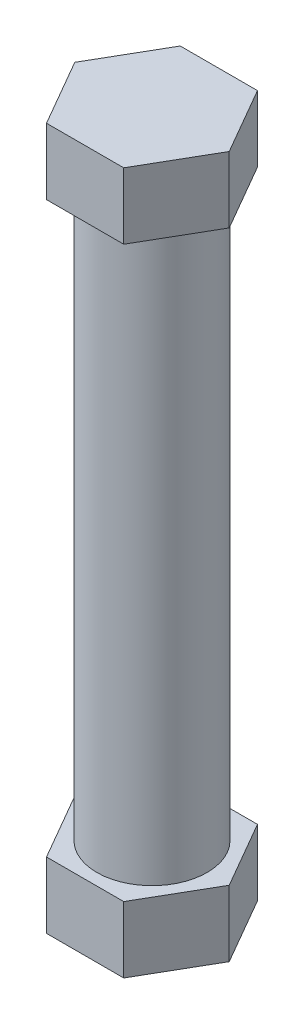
from build123d import *

# Parameters (mm, degrees)
SKETCH1_R           = 3.175
BOSS_EXTRUDE1_DEPTH = 16.383
BOSS_EXTRUDE2_DEPTH = 3.81


with BuildPart() as part:
    # Sketch1 → Boss-Extrude1 (new, symmetric)
    with BuildSketch(Plane(origin=(0, 0, 0), x_dir=(1, 0, 0), z_dir=(0, 1, 0))):
        with Locations(Location((0, 0, 0), (0, 0, 270))):
            Circle(SKETCH1_R)
    extrude(amount=BOSS_EXTRUDE1_DEPTH, both=True)

    # Sketch2 → Boss-Extrude2 (add)
    with BuildSketch(Plane(origin=(0, 16.383, 0), x_dir=(1, 0, 0), z_dir=(0, 1, 0))):
        Polygon((2.2225, 3.84948292), (-2.2225, 3.84948292), (-4.445, 0), (-2.2225, -3.84948292), (2.2225, -3.84948292), (4.445, 0), align=None)
    boss_extrude2 = extrude(amount=BOSS_EXTRUDE2_DEPTH)

    # Mirror1: Boss-Extrude2 across plane
    add(boss_extrude2.mirror(Plane.ZX))


solid = part.part
